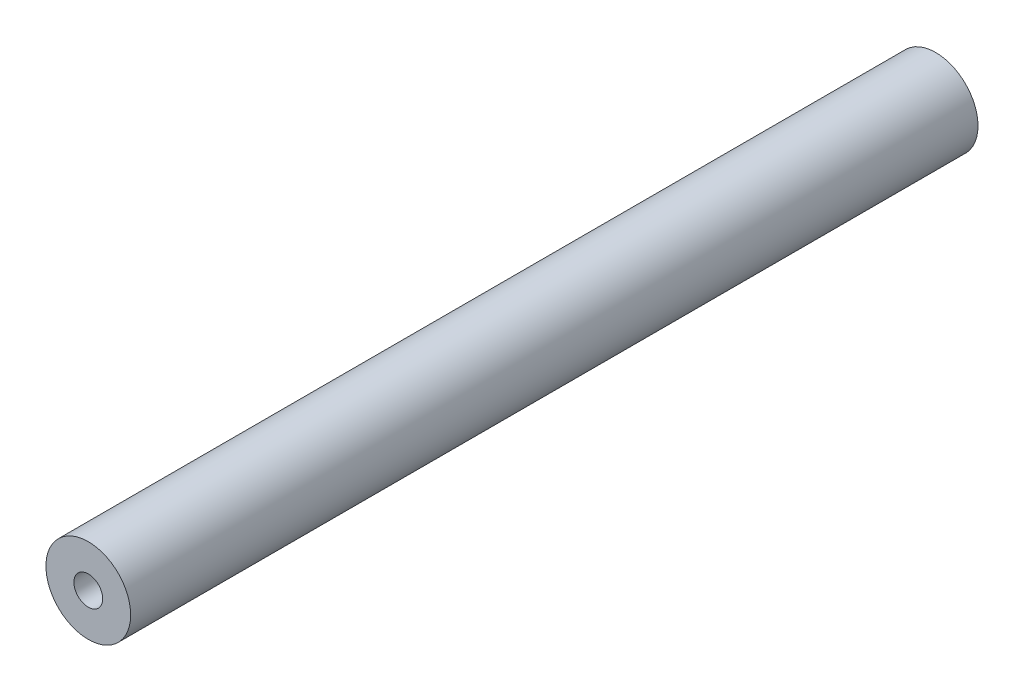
ISO-10303-21;
HEADER;
FILE_DESCRIPTION(('STEP AP214'),'2;1');
FILE_NAME('part.step','',(''),(''),'','','');
FILE_SCHEMA(('AUTOMOTIVE_DESIGN { 1 0 10303 214 1 1 1 1 }'));
ENDSEC;
DATA;
#1=APPLICATION_CONTEXT('core data for automotive mechanical design processes');
#2=APPLICATION_PROTOCOL_DEFINITION('international standard','automotive_design',2000,#1);
#3=PRODUCT_CONTEXT('',#1,'mechanical');
#4=PRODUCT('Part','Part','',(#3));
#5=PRODUCT_RELATED_PRODUCT_CATEGORY('part','',(#4));
#6=PRODUCT_DEFINITION_FORMATION('','',#4);
#7=PRODUCT_DEFINITION_CONTEXT('part definition',#1,'design');
#8=PRODUCT_DEFINITION('design','',#6,#7);
#9=PRODUCT_DEFINITION_SHAPE('','',#8);
#10=(LENGTH_UNIT() NAMED_UNIT(*) SI_UNIT(.MILLI.,.METRE.));
#11=(NAMED_UNIT(*) PLANE_ANGLE_UNIT() SI_UNIT($,.RADIAN.));
#12=(NAMED_UNIT(*) SI_UNIT($,.STERADIAN.) SOLID_ANGLE_UNIT());
#13=UNCERTAINTY_MEASURE_WITH_UNIT(LENGTH_MEASURE(1.E-05),#10,'distance_accuracy_value','');
#14=(GEOMETRIC_REPRESENTATION_CONTEXT(3) GLOBAL_UNCERTAINTY_ASSIGNED_CONTEXT((#13)) GLOBAL_UNIT_ASSIGNED_CONTEXT((#10,
#11,#12)) REPRESENTATION_CONTEXT('',''));
#15=CARTESIAN_POINT('',(0.,0.,0.));
#16=DIRECTION('',(0.,0.,1.));
#17=DIRECTION('',(1.,0.,0.));
#18=AXIS2_PLACEMENT_3D('',#15,#16,#17);
#19=CARTESIAN_POINT('',(0.,0.,200.));
#20=DIRECTION('',(0.,0.,-1.));
#21=DIRECTION('',(-1.,0.,0.));
#22=AXIS2_PLACEMENT_3D('',#19,#20,#21);
#23=CYLINDRICAL_SURFACE('',#22,10.);
#24=CARTESIAN_POINT('',(0.,0.,200.));
#25=DIRECTION('',(0.,0.,1.));
#26=DIRECTION('',(1.,0.,0.));
#27=AXIS2_PLACEMENT_3D('',#24,#25,#26);
#28=CIRCLE('',#27,10.);
#29=CARTESIAN_POINT('',(10.,0.,200.));
#30=VERTEX_POINT('',#29);
#31=EDGE_CURVE('E11',#30,#30,#28,.T.);
#32=ORIENTED_EDGE('',*,*,#31,.F.);
#33=EDGE_LOOP('',(#32));
#34=FACE_BOUND('',#33,.T.);
#35=CARTESIAN_POINT('',(0.,0.,0.));
#36=DIRECTION('',(0.,0.,1.));
#37=DIRECTION('',(1.,0.,0.));
#38=AXIS2_PLACEMENT_3D('',#35,#36,#37);
#39=CIRCLE('',#38,10.);
#40=CARTESIAN_POINT('',(10.,0.,0.));
#41=VERTEX_POINT('',#40);
#42=EDGE_CURVE('E38',#41,#41,#39,.T.);
#43=ORIENTED_EDGE('',*,*,#42,.T.);
#44=EDGE_LOOP('',(#43));
#45=FACE_BOUND('',#44,.T.);
#46=ADVANCED_FACE('F35',(#34,#45),#23,.T.);
#47=CARTESIAN_POINT('',(0.,0.,200.));
#48=DIRECTION('',(0.,0.,1.));
#49=DIRECTION('',(1.,0.,0.));
#50=AXIS2_PLACEMENT_3D('',#47,#48,#49);
#51=PLANE('',#50);
#52=CARTESIAN_POINT('',(0.,0.,200.));
#53=DIRECTION('',(0.,0.,1.));
#54=DIRECTION('',(1.,0.,0.));
#55=AXIS2_PLACEMENT_3D('',#52,#53,#54);
#56=CIRCLE('',#55,3.39999999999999);
#57=CARTESIAN_POINT('',(3.39999999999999,0.,200.));
#58=VERTEX_POINT('',#57);
#59=EDGE_CURVE('E59',#58,#58,#56,.T.);
#60=ORIENTED_EDGE('',*,*,#59,.F.);
#61=EDGE_LOOP('',(#60));
#62=FACE_BOUND('',#61,.T.);
#63=ORIENTED_EDGE('',*,*,#31,.T.);
#64=EDGE_LOOP('',(#63));
#65=FACE_BOUND('',#64,.T.);
#66=ADVANCED_FACE('F77',(#62,#65),#51,.T.);
#67=CARTESIAN_POINT('',(0.,0.,0.));
#68=DIRECTION('',(0.,0.,1.));
#69=DIRECTION('',(1.,0.,0.));
#70=AXIS2_PLACEMENT_3D('',#67,#68,#69);
#71=PLANE('',#70);
#72=CARTESIAN_POINT('',(0.,0.,0.));
#73=DIRECTION('',(0.,0.,-1.));
#74=DIRECTION('',(-1.,0.,0.));
#75=AXIS2_PLACEMENT_3D('',#72,#73,#74);
#76=CIRCLE('',#75,3.4);
#77=CARTESIAN_POINT('',(-3.4,0.,0.));
#78=VERTEX_POINT('',#77);
#79=EDGE_CURVE('E58',#78,#78,#76,.T.);
#80=ORIENTED_EDGE('',*,*,#79,.F.);
#81=EDGE_LOOP('',(#80));
#82=FACE_BOUND('',#81,.T.);
#83=ORIENTED_EDGE('',*,*,#42,.F.);
#84=EDGE_LOOP('',(#83));
#85=FACE_BOUND('',#84,.T.);
#86=ADVANCED_FACE('F74',(#82,#85),#71,.F.);
#87=CARTESIAN_POINT('',(0.,0.,19.75));
#88=DIRECTION('',(0.,0.,-1.));
#89=DIRECTION('',(-1.,0.,0.));
#90=AXIS2_PLACEMENT_3D('',#87,#88,#89);
#91=CONICAL_SURFACE('',#90,3.4,1.02974425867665);
#92=CARTESIAN_POINT('',(0.,0.,21.7929261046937));
#93=VERTEX_POINT('',#92);
#94=VERTEX_LOOP('',#93);
#95=FACE_BOUND('',#94,.T.);
#96=CARTESIAN_POINT('',(0.,0.,19.75));
#97=DIRECTION('',(0.,0.,-1.));
#98=DIRECTION('',(-1.,0.,0.));
#99=AXIS2_PLACEMENT_3D('',#96,#97,#98);
#100=CIRCLE('',#99,3.4);
#101=CARTESIAN_POINT('',(-3.4,0.,19.75));
#102=VERTEX_POINT('',#101);
#103=EDGE_CURVE('E62',#102,#102,#100,.T.);
#104=ORIENTED_EDGE('',*,*,#103,.T.);
#105=EDGE_LOOP('',(#104));
#106=FACE_BOUND('',#105,.T.);
#107=ADVANCED_FACE('F76',(#95,#106),#91,.F.);
#108=CARTESIAN_POINT('',(0.,0.,0.));
#109=DIRECTION('',(0.,0.,-1.));
#110=DIRECTION('',(-1.,0.,0.));
#111=AXIS2_PLACEMENT_3D('',#108,#109,#110);
#112=CYLINDRICAL_SURFACE('',#111,3.4);
#113=ORIENTED_EDGE('',*,*,#103,.F.);
#114=EDGE_LOOP('',(#113));
#115=FACE_BOUND('',#114,.T.);
#116=ORIENTED_EDGE('',*,*,#79,.T.);
#117=EDGE_LOOP('',(#116));
#118=FACE_BOUND('',#117,.T.);
#119=ADVANCED_FACE('F52',(#115,#118),#112,.F.);
#120=CARTESIAN_POINT('',(0.,0.,180.25));
#121=DIRECTION('',(0.,0.,1.));
#122=DIRECTION('',(1.,0.,0.));
#123=AXIS2_PLACEMENT_3D('',#120,#121,#122);
#124=CONICAL_SURFACE('',#123,3.39999999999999,1.02974425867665);
#125=CARTESIAN_POINT('',(0.,0.,178.207073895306));
#126=VERTEX_POINT('',#125);
#127=VERTEX_LOOP('',#126);
#128=FACE_BOUND('',#127,.T.);
#129=CARTESIAN_POINT('',(0.,0.,180.25));
#130=DIRECTION('',(0.,0.,1.));
#131=DIRECTION('',(1.,0.,0.));
#132=AXIS2_PLACEMENT_3D('',#129,#130,#131);
#133=CIRCLE('',#132,3.39999999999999);
#134=CARTESIAN_POINT('',(3.39999999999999,0.,180.25));
#135=VERTEX_POINT('',#134);
#136=EDGE_CURVE('E56',#135,#135,#133,.T.);
#137=ORIENTED_EDGE('',*,*,#136,.T.);
#138=EDGE_LOOP('',(#137));
#139=FACE_BOUND('',#138,.T.);
#140=ADVANCED_FACE('F48',(#128,#139),#124,.F.);
#141=CARTESIAN_POINT('',(0.,0.,200.));
#142=DIRECTION('',(0.,0.,1.));
#143=DIRECTION('',(1.,0.,0.));
#144=AXIS2_PLACEMENT_3D('',#141,#142,#143);
#145=CYLINDRICAL_SURFACE('',#144,3.39999999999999);
#146=ORIENTED_EDGE('',*,*,#136,.F.);
#147=EDGE_LOOP('',(#146));
#148=FACE_BOUND('',#147,.T.);
#149=ORIENTED_EDGE('',*,*,#59,.T.);
#150=EDGE_LOOP('',(#149));
#151=FACE_BOUND('',#150,.T.);
#152=ADVANCED_FACE('F51',(#148,#151),#145,.F.);
#153=CLOSED_SHELL('',(#46,#66,#86,#107,#119,#140,#152));
#154=MANIFOLD_SOLID_BREP('B2',#153);
#155=ADVANCED_BREP_SHAPE_REPRESENTATION('',(#18,#154),#14);
#156=SHAPE_DEFINITION_REPRESENTATION(#9,#155);
ENDSEC;
END-ISO-10303-21;
